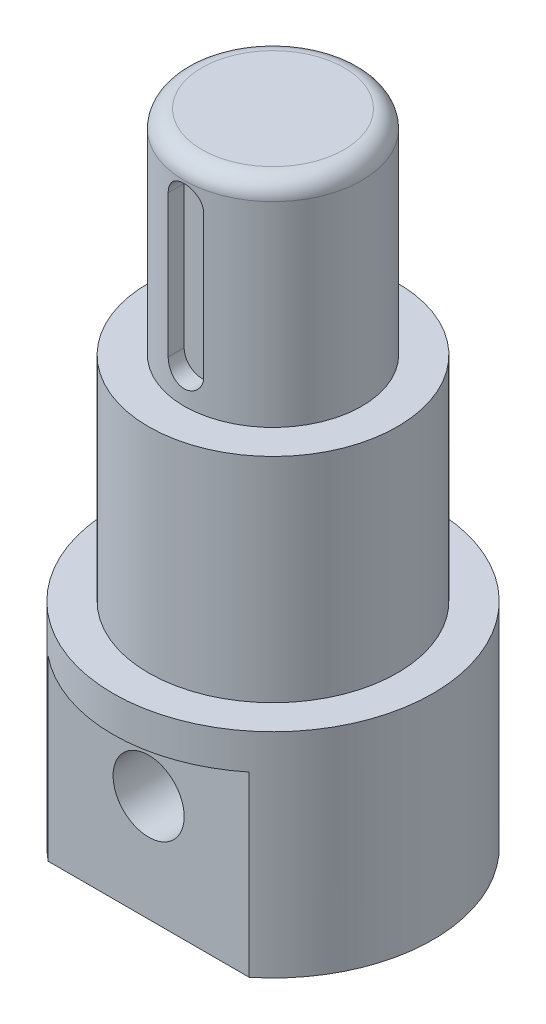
from build123d import *

# Parameters (mm, degrees)
CROQUIS2_R                 = 18
SALIENTE_EXTRUIR1_DEPTH    = 12
CORTAR_EXTRUIR1_DEPTH      = 29.142494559
CORTAR_EXTRUIR1_DEPTH_BACK = 29.142494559
CROQUIS4_R                 = 4
CROQUIS5_W                 = 4
CROQUIS5_H                 = 20
CORTAR_EXTRUIR2_DEPTH      = 29.14249473
CROQUIS6_R                 = 14
SALIENTE_EXTRUIR2_DEPTH    = 24
CROQUIS7_R                 = 10
SALIENTE_EXTRUIR3_DEPTH    = 24
CORTAR_EXTRUIR4_DEPTH      = 2
REDONDEO1_R                = 2


with BuildPart() as part:
    # Croquis2 → Saliente-Extruir1 (new, symmetric)
    with BuildSketch(Plane(origin=(0, 0, 0), x_dir=(1, 0, 0), z_dir=(0, 1, 0))):
        with Locations(Location((0, 0, 0), (0, 0, 270))):
            Circle(CROQUIS2_R)
    extrude(amount=SALIENTE_EXTRUIR1_DEPTH, both=True)

    # Croquis4 → Cortar-Extruir1 (cut, two sides: drawn at the far end of the back side and taken through both)
    with BuildSketch(Plane.XY.offset(-CORTAR_EXTRUIR1_DEPTH_BACK)):
        with Locations(Location((0, 0, 0), (0, 0, 90.000000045))):
            Circle(CROQUIS4_R)
    extrude(amount=CORTAR_EXTRUIR1_DEPTH + CORTAR_EXTRUIR1_DEPTH_BACK, mode=Mode.SUBTRACT)

    # Croquis5 → Cortar-Extruir2 (cut, symmetric)
    with BuildSketch(Plane(origin=(0, 0, 0), x_dir=(0, 0, -1), z_dir=(1, 0, 0))):
        with Locations((-16, -2)):
            Rectangle(CROQUIS5_W, CROQUIS5_H)
    cortar_extruir2 = extrude(amount=CORTAR_EXTRUIR2_DEPTH, both=True, mode=Mode.SUBTRACT)

    # Simetr_a1: Cortar-Extruir2 across plane
    add(cortar_extruir2.mirror(Plane.XY), mode=Mode.SUBTRACT)

    # Croquis6 → Saliente-Extruir2 (add)
    with BuildSketch(Plane(origin=(0, 12, 0), x_dir=(1, 0, 0), z_dir=(0, 1, 0))):
        with Locations(Location((0, 0, 0), (0, 0, 270))):
            Circle(CROQUIS6_R)
    extrude(amount=SALIENTE_EXTRUIR2_DEPTH)

    # Croquis7 → Saliente-Extruir3 (add)
    with BuildSketch(Plane(origin=(0, 36, 0), x_dir=(1, 0, 0), z_dir=(0, 1, 0))):
        with Locations(Location((0, 0, 0), (0, 0, 270))):
            Circle(CROQUIS7_R)
    extrude(amount=SALIENTE_EXTRUIR3_DEPTH)

    # Croquis10 → Cortar-Extruir4 (cut)
    with BuildSketch(Plane.XY.offset(8)):
        with BuildLine():
            Line((2, 55.704671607), (2, 39.704671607))
            ThreePointArc((2, 39.704671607), (0, 37.704671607), (-2, 39.704671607))
            Line((-2, 39.704671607), (-2, 55.704671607))
            ThreePointArc((-2, 55.704671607), (0, 57.704671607), (2, 55.704671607))
        make_face()
    cortar_extruir4 = extrude(amount=CORTAR_EXTRUIR4_DEPTH, mode=Mode.SUBTRACT)

    # Simetr_a2: Cortar-Extruir4 across plane
    add(cortar_extruir4.mirror(Plane.XY), mode=Mode.SUBTRACT)

    # Redondeo1
    redondeo1_edges = [part.edges().sort_by_distance(p)[0] for p in [
        (0, 60, -10),
    ]]
    fillet(redondeo1_edges, radius=REDONDEO1_R)


solid = part.part
